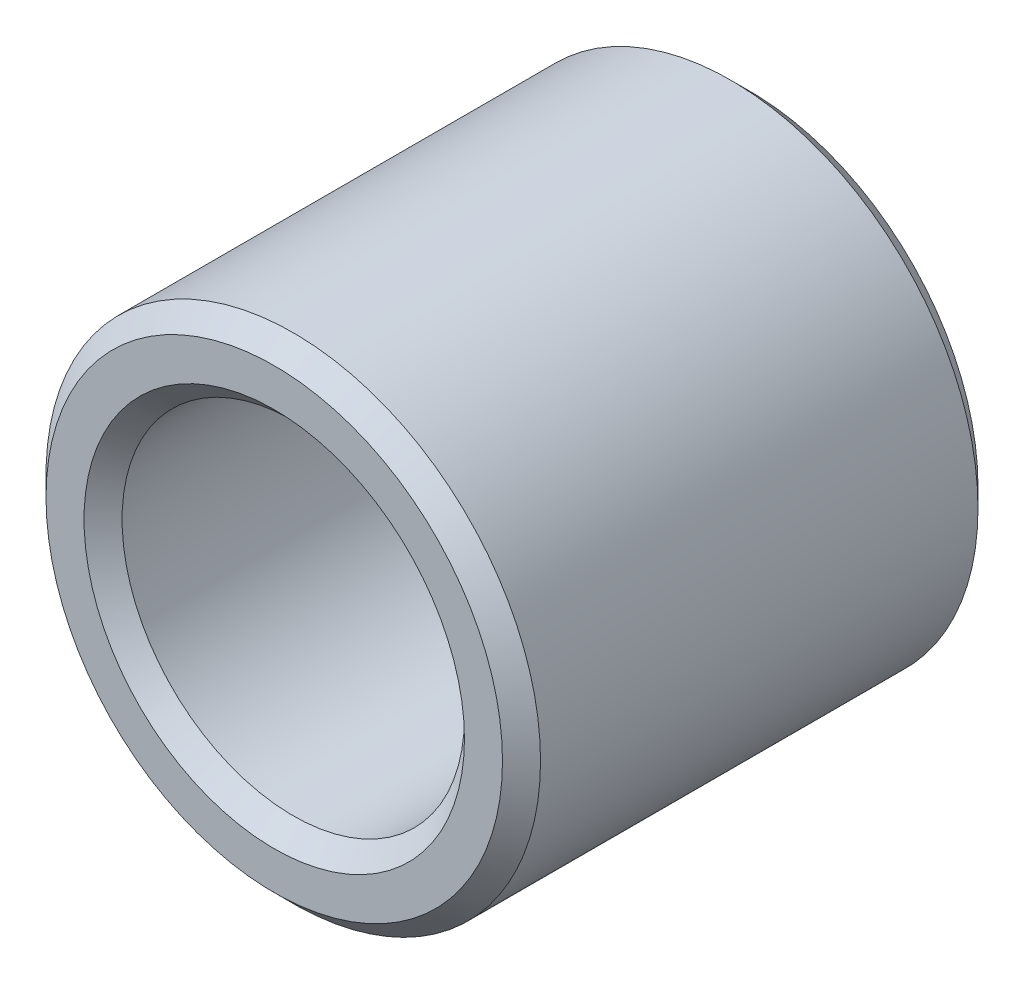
ISO-10303-21;
HEADER;
FILE_DESCRIPTION(('STEP AP214'),'2;1');
FILE_NAME('part.step','',(''),(''),'','','');
FILE_SCHEMA(('AUTOMOTIVE_DESIGN { 1 0 10303 214 1 1 1 1 }'));
ENDSEC;
DATA;
#1=APPLICATION_CONTEXT('core data for automotive mechanical design processes');
#2=APPLICATION_PROTOCOL_DEFINITION('international standard','automotive_design',2000,#1);
#3=PRODUCT_CONTEXT('',#1,'mechanical');
#4=PRODUCT('Part','Part','',(#3));
#5=PRODUCT_RELATED_PRODUCT_CATEGORY('part','',(#4));
#6=PRODUCT_DEFINITION_FORMATION('','',#4);
#7=PRODUCT_DEFINITION_CONTEXT('part definition',#1,'design');
#8=PRODUCT_DEFINITION('design','',#6,#7);
#9=PRODUCT_DEFINITION_SHAPE('','',#8);
#10=(LENGTH_UNIT() NAMED_UNIT(*) SI_UNIT(.MILLI.,.METRE.));
#11=(NAMED_UNIT(*) PLANE_ANGLE_UNIT() SI_UNIT($,.RADIAN.));
#12=(NAMED_UNIT(*) SI_UNIT($,.STERADIAN.) SOLID_ANGLE_UNIT());
#13=UNCERTAINTY_MEASURE_WITH_UNIT(LENGTH_MEASURE(1.E-05),#10,'distance_accuracy_value','');
#14=(GEOMETRIC_REPRESENTATION_CONTEXT(3) GLOBAL_UNCERTAINTY_ASSIGNED_CONTEXT((#13)) GLOBAL_UNIT_ASSIGNED_CONTEXT((#10,
#11,#12)) REPRESENTATION_CONTEXT('',''));
#15=CARTESIAN_POINT('',(0.,0.,0.));
#16=DIRECTION('',(0.,0.,1.));
#17=DIRECTION('',(1.,0.,0.));
#18=AXIS2_PLACEMENT_3D('',#15,#16,#17);
#19=CARTESIAN_POINT('',(0.,0.,12.5));
#20=DIRECTION('',(0.,0.,1.));
#21=DIRECTION('',(1.,0.,0.));
#22=AXIS2_PLACEMENT_3D('',#19,#20,#21);
#23=PLANE('',#22);
#24=CARTESIAN_POINT('',(0.,0.,12.5));
#25=DIRECTION('',(0.,0.,1.));
#26=DIRECTION('',(1.,0.,0.));
#27=AXIS2_PLACEMENT_3D('',#24,#25,#26);
#28=CIRCLE('',#27,5.99999999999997);
#29=CARTESIAN_POINT('',(5.99999999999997,0.,12.5));
#30=VERTEX_POINT('',#29);
#31=EDGE_CURVE('E56',#30,#30,#28,.T.);
#32=ORIENTED_EDGE('',*,*,#31,.T.);
#33=EDGE_LOOP('',(#32));
#34=FACE_BOUND('',#33,.T.);
#35=CARTESIAN_POINT('',(0.,0.,12.5));
#36=DIRECTION('',(0.,0.,1.));
#37=DIRECTION('',(1.,0.,0.));
#38=AXIS2_PLACEMENT_3D('',#35,#36,#37);
#39=CIRCLE('',#38,5.);
#40=CARTESIAN_POINT('',(5.,0.,12.5));
#41=VERTEX_POINT('',#40);
#42=EDGE_CURVE('E59',#41,#41,#39,.F.);
#43=ORIENTED_EDGE('',*,*,#42,.T.);
#44=EDGE_LOOP('',(#43));
#45=FACE_BOUND('',#44,.T.);
#46=ADVANCED_FACE('F29',(#34,#45),#23,.T.);
#47=CARTESIAN_POINT('',(0.,0.,0.));
#48=DIRECTION('',(0.,0.,1.));
#49=DIRECTION('',(1.,0.,0.));
#50=AXIS2_PLACEMENT_3D('',#47,#48,#49);
#51=PLANE('',#50);
#52=CARTESIAN_POINT('',(0.,0.,0.));
#53=DIRECTION('',(0.,0.,1.));
#54=DIRECTION('',(1.,0.,0.));
#55=AXIS2_PLACEMENT_3D('',#52,#53,#54);
#56=CIRCLE('',#55,5.99999999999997);
#57=CARTESIAN_POINT('',(5.99999999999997,0.,0.));
#58=VERTEX_POINT('',#57);
#59=EDGE_CURVE('E10',#58,#58,#56,.F.);
#60=ORIENTED_EDGE('',*,*,#59,.T.);
#61=EDGE_LOOP('',(#60));
#62=FACE_BOUND('',#61,.T.);
#63=CARTESIAN_POINT('',(0.,0.,0.));
#64=DIRECTION('',(0.,0.,1.));
#65=DIRECTION('',(1.,0.,0.));
#66=AXIS2_PLACEMENT_3D('',#63,#64,#65);
#67=CIRCLE('',#66,5.);
#68=CARTESIAN_POINT('',(5.,0.,0.));
#69=VERTEX_POINT('',#68);
#70=EDGE_CURVE('E36',#69,#69,#67,.T.);
#71=ORIENTED_EDGE('',*,*,#70,.T.);
#72=EDGE_LOOP('',(#71));
#73=FACE_BOUND('',#72,.T.);
#74=ADVANCED_FACE('F88',(#62,#73),#51,.F.);
#75=CARTESIAN_POINT('',(0.,0.,12.5));
#76=DIRECTION('',(0.,0.,-1.));
#77=DIRECTION('',(-1.,0.,0.));
#78=AXIS2_PLACEMENT_3D('',#75,#76,#77);
#79=CYLINDRICAL_SURFACE('',#78,6.49999999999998);
#80=CARTESIAN_POINT('',(0.,0.,12.));
#81=DIRECTION('',(0.,0.,1.));
#82=DIRECTION('',(1.,0.,0.));
#83=AXIS2_PLACEMENT_3D('',#80,#81,#82);
#84=CIRCLE('',#83,6.49999999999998);
#85=CARTESIAN_POINT('',(6.49999999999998,0.,12.));
#86=VERTEX_POINT('',#85);
#87=EDGE_CURVE('E49',#86,#86,#84,.F.);
#88=ORIENTED_EDGE('',*,*,#87,.T.);
#89=EDGE_LOOP('',(#88));
#90=FACE_BOUND('',#89,.T.);
#91=CARTESIAN_POINT('',(0.,0.,0.500000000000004));
#92=DIRECTION('',(0.,0.,1.));
#93=DIRECTION('',(1.,0.,0.));
#94=AXIS2_PLACEMENT_3D('',#91,#92,#93);
#95=CIRCLE('',#94,6.49999999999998);
#96=CARTESIAN_POINT('',(6.49999999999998,0.,0.500000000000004));
#97=VERTEX_POINT('',#96);
#98=EDGE_CURVE('E53',#97,#97,#95,.T.);
#99=ORIENTED_EDGE('',*,*,#98,.T.);
#100=EDGE_LOOP('',(#99));
#101=FACE_BOUND('',#100,.T.);
#102=ADVANCED_FACE('F31',(#90,#101),#79,.T.);
#103=CARTESIAN_POINT('',(0.,0.,12.5));
#104=DIRECTION('',(0.,0.,-1.));
#105=DIRECTION('',(-1.,0.,0.));
#106=AXIS2_PLACEMENT_3D('',#103,#104,#105);
#107=CYLINDRICAL_SURFACE('',#106,4.49999999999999);
#108=CARTESIAN_POINT('',(0.,0.,12.));
#109=DIRECTION('',(0.,0.,1.));
#110=DIRECTION('',(1.,0.,0.));
#111=AXIS2_PLACEMENT_3D('',#108,#109,#110);
#112=CIRCLE('',#111,4.49999999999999);
#113=CARTESIAN_POINT('',(4.49999999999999,0.,12.));
#114=VERTEX_POINT('',#113);
#115=EDGE_CURVE('E40',#114,#114,#112,.T.);
#116=ORIENTED_EDGE('',*,*,#115,.T.);
#117=EDGE_LOOP('',(#116));
#118=FACE_BOUND('',#117,.T.);
#119=CARTESIAN_POINT('',(0.,0.,0.500000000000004));
#120=DIRECTION('',(0.,0.,1.));
#121=DIRECTION('',(1.,0.,0.));
#122=AXIS2_PLACEMENT_3D('',#119,#120,#121);
#123=CIRCLE('',#122,4.49999999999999);
#124=CARTESIAN_POINT('',(4.49999999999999,0.,0.500000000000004));
#125=VERTEX_POINT('',#124);
#126=EDGE_CURVE('E44',#125,#125,#123,.F.);
#127=ORIENTED_EDGE('',*,*,#126,.T.);
#128=EDGE_LOOP('',(#127));
#129=FACE_BOUND('',#128,.T.);
#130=ADVANCED_FACE('F72',(#118,#129),#107,.F.);
#131=CARTESIAN_POINT('',(0.,0.,12.5));
#132=DIRECTION('',(0.,0.,-1.));
#133=DIRECTION('',(-1.,0.,0.));
#134=AXIS2_PLACEMENT_3D('',#131,#132,#133);
#135=CONICAL_SURFACE('',#134,5.99999999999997,0.785398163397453);
#136=ORIENTED_EDGE('',*,*,#87,.F.);
#137=EDGE_LOOP('',(#136));
#138=FACE_BOUND('',#137,.T.);
#139=ORIENTED_EDGE('',*,*,#31,.F.);
#140=EDGE_LOOP('',(#139));
#141=FACE_BOUND('',#140,.T.);
#142=ADVANCED_FACE('F68',(#138,#141),#135,.T.);
#143=CARTESIAN_POINT('',(0.,0.,12.));
#144=DIRECTION('',(0.,0.,1.));
#145=DIRECTION('',(1.,0.,0.));
#146=AXIS2_PLACEMENT_3D('',#143,#144,#145);
#147=CONICAL_SURFACE('',#146,4.49999999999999,0.785398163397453);
#148=ORIENTED_EDGE('',*,*,#42,.F.);
#149=EDGE_LOOP('',(#148));
#150=FACE_BOUND('',#149,.T.);
#151=ORIENTED_EDGE('',*,*,#115,.F.);
#152=EDGE_LOOP('',(#151));
#153=FACE_BOUND('',#152,.T.);
#154=ADVANCED_FACE('F64',(#150,#153),#147,.F.);
#155=CARTESIAN_POINT('',(0.,0.,0.500000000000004));
#156=DIRECTION('',(0.,0.,1.));
#157=DIRECTION('',(1.,0.,0.));
#158=AXIS2_PLACEMENT_3D('',#155,#156,#157);
#159=CONICAL_SURFACE('',#158,6.49999999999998,0.785398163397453);
#160=ORIENTED_EDGE('',*,*,#59,.F.);
#161=EDGE_LOOP('',(#160));
#162=FACE_BOUND('',#161,.T.);
#163=ORIENTED_EDGE('',*,*,#98,.F.);
#164=EDGE_LOOP('',(#163));
#165=FACE_BOUND('',#164,.T.);
#166=ADVANCED_FACE('F67',(#162,#165),#159,.T.);
#167=CARTESIAN_POINT('',(0.,0.,0.));
#168=DIRECTION('',(0.,0.,-1.));
#169=DIRECTION('',(-1.,0.,0.));
#170=AXIS2_PLACEMENT_3D('',#167,#168,#169);
#171=CONICAL_SURFACE('',#170,5.,0.785398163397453);
#172=ORIENTED_EDGE('',*,*,#126,.F.);
#173=EDGE_LOOP('',(#172));
#174=FACE_BOUND('',#173,.T.);
#175=ORIENTED_EDGE('',*,*,#70,.F.);
#176=EDGE_LOOP('',(#175));
#177=FACE_BOUND('',#176,.T.);
#178=ADVANCED_FACE('F78',(#174,#177),#171,.F.);
#179=CLOSED_SHELL('',(#46,#74,#102,#130,#142,#154,#166,#178));
#180=MANIFOLD_SOLID_BREP('B2',#179);
#181=ADVANCED_BREP_SHAPE_REPRESENTATION('',(#18,#180),#14);
#182=SHAPE_DEFINITION_REPRESENTATION(#9,#181);
ENDSEC;
END-ISO-10303-21;
